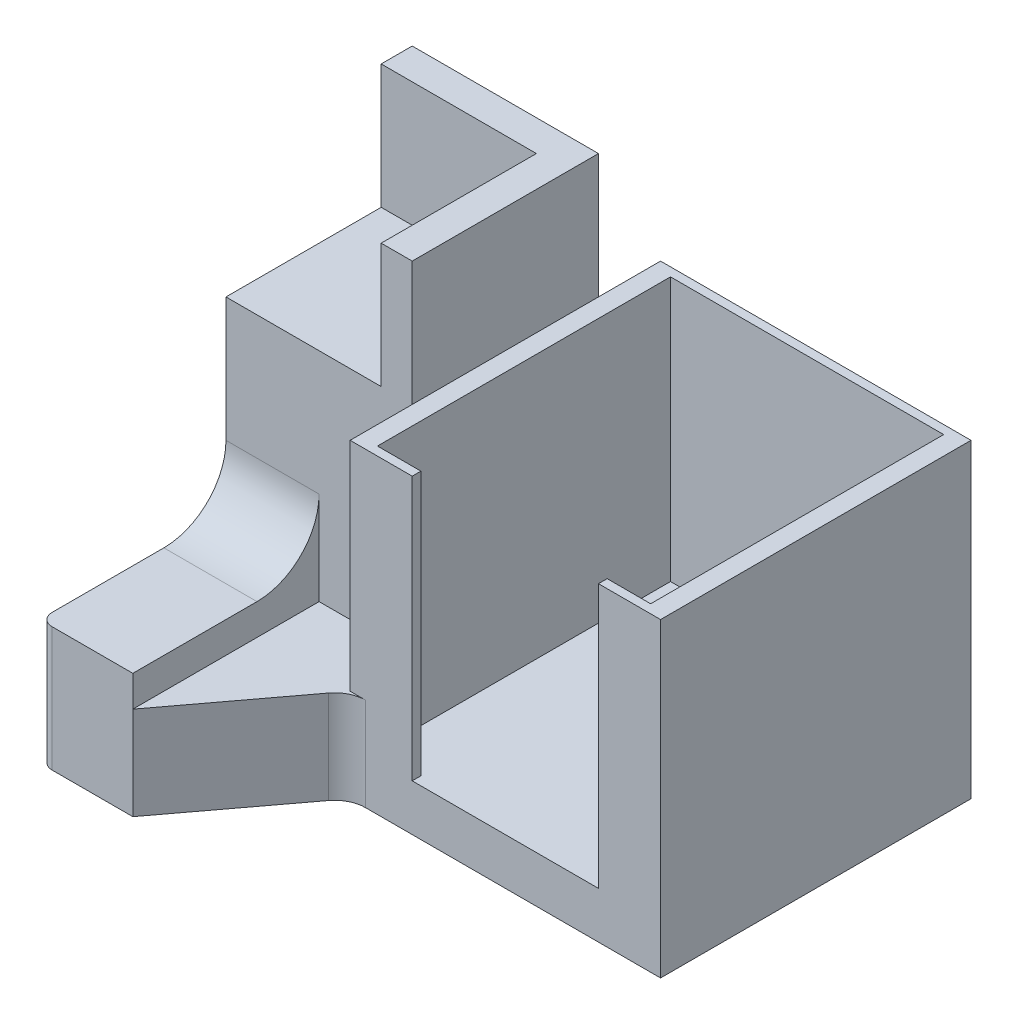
ISO-10303-21;
HEADER;
FILE_DESCRIPTION(('STEP AP214'),'2;1');
FILE_NAME('part.step','',(''),(''),'','','');
FILE_SCHEMA(('AUTOMOTIVE_DESIGN { 1 0 10303 214 1 1 1 1 }'));
ENDSEC;
DATA;
#1=APPLICATION_CONTEXT('core data for automotive mechanical design processes');
#2=APPLICATION_PROTOCOL_DEFINITION('international standard','automotive_design',2000,#1);
#3=PRODUCT_CONTEXT('',#1,'mechanical');
#4=PRODUCT('Part','Part','',(#3));
#5=PRODUCT_RELATED_PRODUCT_CATEGORY('part','',(#4));
#6=PRODUCT_DEFINITION_FORMATION('','',#4);
#7=PRODUCT_DEFINITION_CONTEXT('part definition',#1,'design');
#8=PRODUCT_DEFINITION('design','',#6,#7);
#9=PRODUCT_DEFINITION_SHAPE('','',#8);
#10=(LENGTH_UNIT() NAMED_UNIT(*) SI_UNIT(.MILLI.,.METRE.));
#11=(NAMED_UNIT(*) PLANE_ANGLE_UNIT() SI_UNIT($,.RADIAN.));
#12=(NAMED_UNIT(*) SI_UNIT($,.STERADIAN.) SOLID_ANGLE_UNIT());
#13=UNCERTAINTY_MEASURE_WITH_UNIT(LENGTH_MEASURE(1.E-05),#10,'distance_accuracy_value','');
#14=(GEOMETRIC_REPRESENTATION_CONTEXT(3) GLOBAL_UNCERTAINTY_ASSIGNED_CONTEXT((#13)) GLOBAL_UNIT_ASSIGNED_CONTEXT((#10,
#11,#12)) REPRESENTATION_CONTEXT('',''));
#15=CARTESIAN_POINT('',(0.,0.,0.));
#16=DIRECTION('',(0.,0.,1.));
#17=DIRECTION('',(1.,0.,0.));
#18=AXIS2_PLACEMENT_3D('',#15,#16,#17);
#19=CARTESIAN_POINT('',(-25.,25.,50.));
#20=DIRECTION('',(0.,-1.,0.));
#21=DIRECTION('',(0.,0.,-1.));
#22=AXIS2_PLACEMENT_3D('',#19,#20,#21);
#23=PLANE('',#22);
#24=DIRECTION('',(0.,0.,-1.));
#25=VECTOR('',#24,1.);
#26=CARTESIAN_POINT('',(-25.,25.,10.));
#27=LINE('',#26,#25);
#28=CARTESIAN_POINT('',(-25.,25.,40.));
#29=VERTEX_POINT('',#28);
#30=CARTESIAN_POINT('',(-25.,25.,10.));
#31=VERTEX_POINT('',#30);
#32=EDGE_CURVE('E275',#29,#31,#27,.T.);
#33=ORIENTED_EDGE('',*,*,#32,.F.);
#34=DIRECTION('',(0.,0.,-1.));
#35=VECTOR('',#34,1.);
#36=CARTESIAN_POINT('',(-25.,25.,50.));
#37=LINE('',#36,#35);
#38=CARTESIAN_POINT('',(-25.,25.,50.));
#39=VERTEX_POINT('',#38);
#40=EDGE_CURVE('E465',#39,#29,#37,.T.);
#41=ORIENTED_EDGE('',*,*,#40,.F.);
#42=DIRECTION('',(-1.,0.,0.));
#43=VECTOR('',#42,1.);
#44=CARTESIAN_POINT('',(-25.,25.,50.));
#45=LINE('',#44,#43);
#46=CARTESIAN_POINT('',(-15.,25.,50.));
#47=VERTEX_POINT('',#46);
#48=EDGE_CURVE('E440',#47,#39,#45,.T.);
#49=ORIENTED_EDGE('',*,*,#48,.F.);
#50=DIRECTION('',(0.,0.,1.));
#51=VECTOR('',#50,1.);
#52=CARTESIAN_POINT('',(-15.,25.,48.6));
#53=LINE('',#52,#51);
#54=CARTESIAN_POINT('',(-15.,25.,48.6));
#55=VERTEX_POINT('',#54);
#56=EDGE_CURVE('E404',#55,#47,#53,.T.);
#57=ORIENTED_EDGE('',*,*,#56,.F.);
#58=DIRECTION('',(1.,0.,0.));
#59=VECTOR('',#58,1.);
#60=CARTESIAN_POINT('',(-22.,25.,48.6));
#61=LINE('',#60,#59);
#62=CARTESIAN_POINT('',(-22.,25.,48.6));
#63=VERTEX_POINT('',#62);
#64=EDGE_CURVE('E379',#63,#55,#61,.T.);
#65=ORIENTED_EDGE('',*,*,#64,.F.);
#66=DIRECTION('',(0.,0.,-1.));
#67=VECTOR('',#66,1.);
#68=CARTESIAN_POINT('',(-22.,25.,48.6));
#69=LINE('',#68,#67);
#70=CARTESIAN_POINT('',(-22.,25.,1.4));
#71=VERTEX_POINT('',#70);
#72=EDGE_CURVE('E384',#63,#71,#69,.T.);
#73=ORIENTED_EDGE('',*,*,#72,.T.);
#74=DIRECTION('',(1.,0.,0.));
#75=VECTOR('',#74,1.);
#76=CARTESIAN_POINT('',(-22.,25.,1.4));
#77=LINE('',#76,#75);
#78=CARTESIAN_POINT('',(22.,25.,1.4));
#79=VERTEX_POINT('',#78);
#80=EDGE_CURVE('E415',#71,#79,#77,.T.);
#81=ORIENTED_EDGE('',*,*,#80,.T.);
#82=DIRECTION('',(0.,0.,-1.));
#83=VECTOR('',#82,1.);
#84=CARTESIAN_POINT('',(22.,25.,48.6));
#85=LINE('',#84,#83);
#86=CARTESIAN_POINT('',(22.,25.,48.6));
#87=VERTEX_POINT('',#86);
#88=EDGE_CURVE('E412',#87,#79,#85,.T.);
#89=ORIENTED_EDGE('',*,*,#88,.F.);
#90=DIRECTION('',(1.,0.,0.));
#91=VECTOR('',#90,1.);
#92=CARTESIAN_POINT('',(15.,25.,48.6));
#93=LINE('',#92,#91);
#94=CARTESIAN_POINT('',(15.,25.,48.6));
#95=VERTEX_POINT('',#94);
#96=EDGE_CURVE('E409',#95,#87,#93,.T.);
#97=ORIENTED_EDGE('',*,*,#96,.F.);
#98=DIRECTION('',(0.,0.,1.));
#99=VECTOR('',#98,1.);
#100=CARTESIAN_POINT('',(15.,25.,48.6));
#101=LINE('',#100,#99);
#102=CARTESIAN_POINT('',(15.,25.,50.));
#103=VERTEX_POINT('',#102);
#104=EDGE_CURVE('E406',#95,#103,#101,.T.);
#105=ORIENTED_EDGE('',*,*,#104,.T.);
#106=CARTESIAN_POINT('',(25.,25.,50.));
#107=VERTEX_POINT('',#106);
#108=EDGE_CURVE('E442',#107,#103,#45,.T.);
#109=ORIENTED_EDGE('',*,*,#108,.F.);
#110=DIRECTION('',(0.,0.,-1.));
#111=VECTOR('',#110,1.);
#112=CARTESIAN_POINT('',(25.,25.,50.));
#113=LINE('',#112,#111);
#114=CARTESIAN_POINT('',(25.,25.,0.));
#115=VERTEX_POINT('',#114);
#116=EDGE_CURVE('E468',#107,#115,#113,.T.);
#117=ORIENTED_EDGE('',*,*,#116,.T.);
#118=DIRECTION('',(-1.,0.,0.));
#119=VECTOR('',#118,1.);
#120=CARTESIAN_POINT('',(-25.,25.,0.));
#121=LINE('',#120,#119);
#122=CARTESIAN_POINT('',(-25.,25.,0.));
#123=VERTEX_POINT('',#122);
#124=EDGE_CURVE('E453',#115,#123,#121,.T.);
#125=ORIENTED_EDGE('',*,*,#124,.T.);
#126=EDGE_CURVE('E464',#31,#123,#37,.T.);
#127=ORIENTED_EDGE('',*,*,#126,.F.);
#128=EDGE_LOOP('',(#33,#41,#49,#57,#65,#73,#81,#89,#97,#105,#109,#117,#125,#127));
#129=FACE_BOUND('',#128,.T.);
#130=ADVANCED_FACE('F41',(#129),#23,.F.);
#131=DIRECTION('',(0.,0.,1.));
#132=VECTOR('',#131,1.);
#133=CARTESIAN_POINT('',(-30.,25.,40.));
#134=LINE('',#133,#132);
#135=CARTESIAN_POINT('',(-30.,25.,15.));
#136=VERTEX_POINT('',#135);
#137=CARTESIAN_POINT('',(-30.,25.,40.));
#138=VERTEX_POINT('',#137);
#139=EDGE_CURVE('E278',#136,#138,#134,.T.);
#140=ORIENTED_EDGE('',*,*,#139,.F.);
#141=DIRECTION('',(1.,0.,0.));
#142=VECTOR('',#141,1.);
#143=CARTESIAN_POINT('',(-30.,25.,15.));
#144=LINE('',#143,#142);
#145=CARTESIAN_POINT('',(-55.,25.,15.));
#146=VERTEX_POINT('',#145);
#147=EDGE_CURVE('E61',#146,#136,#144,.T.);
#148=ORIENTED_EDGE('',*,*,#147,.F.);
#149=DIRECTION('',(0.,0.,-1.));
#150=VECTOR('',#149,1.);
#151=CARTESIAN_POINT('',(-55.,25.,10.));
#152=LINE('',#151,#150);
#153=CARTESIAN_POINT('',(-55.,25.,40.));
#154=VERTEX_POINT('',#153);
#155=EDGE_CURVE('E372',#154,#146,#152,.T.);
#156=ORIENTED_EDGE('',*,*,#155,.F.);
#157=DIRECTION('',(1.,0.,0.));
#158=VECTOR('',#157,1.);
#159=CARTESIAN_POINT('',(-55.,25.,40.));
#160=LINE('',#159,#158);
#161=EDGE_CURVE('E56',#154,#138,#160,.T.);
#162=ORIENTED_EDGE('',*,*,#161,.T.);
#163=EDGE_LOOP('',(#140,#148,#156,#162));
#164=FACE_BOUND('',#163,.T.);
#165=ADVANCED_FACE('F539',(#164),#23,.F.);
#166=CARTESIAN_POINT('',(-55.,25.,40.));
#167=DIRECTION('',(0.,0.,-1.));
#168=DIRECTION('',(0.,1.,0.));
#169=AXIS2_PLACEMENT_3D('',#166,#167,#168);
#170=PLANE('',#169);
#171=DIRECTION('',(-1.,0.,0.));
#172=VECTOR('',#171,1.);
#173=CARTESIAN_POINT('',(-25.,-10.,40.));
#174=LINE('',#173,#172);
#175=CARTESIAN_POINT('',(-25.,-10.,40.));
#176=VERTEX_POINT('',#175);
#177=CARTESIAN_POINT('',(-40.,-10.,40.));
#178=VERTEX_POINT('',#177);
#179=EDGE_CURVE('E309',#176,#178,#174,.T.);
#180=ORIENTED_EDGE('',*,*,#179,.F.);
#181=DIRECTION('',(0.,1.,0.));
#182=VECTOR('',#181,1.);
#183=CARTESIAN_POINT('',(-25.,25.,40.));
#184=LINE('',#183,#182);
#185=EDGE_CURVE('E259',#176,#29,#184,.T.);
#186=ORIENTED_EDGE('',*,*,#185,.T.);
#187=DIRECTION('',(0.,-1.,0.));
#188=VECTOR('',#187,1.);
#189=CARTESIAN_POINT('',(-25.,45.,40.));
#190=LINE('',#189,#188);
#191=CARTESIAN_POINT('',(-25.,45.,40.));
#192=VERTEX_POINT('',#191);
#193=EDGE_CURVE('E291',#192,#29,#190,.T.);
#194=ORIENTED_EDGE('',*,*,#193,.F.);
#195=DIRECTION('',(1.,0.,0.));
#196=VECTOR('',#195,1.);
#197=CARTESIAN_POINT('',(-25.,45.,40.));
#198=LINE('',#197,#196);
#199=CARTESIAN_POINT('',(-30.,45.,40.));
#200=VERTEX_POINT('',#199);
#201=EDGE_CURVE('E284',#200,#192,#198,.T.);
#202=ORIENTED_EDGE('',*,*,#201,.F.);
#203=DIRECTION('',(0.,-1.,0.));
#204=VECTOR('',#203,1.);
#205=CARTESIAN_POINT('',(-30.,45.,40.));
#206=LINE('',#205,#204);
#207=EDGE_CURVE('E294',#200,#138,#206,.T.);
#208=ORIENTED_EDGE('',*,*,#207,.T.);
#209=ORIENTED_EDGE('',*,*,#161,.F.);
#210=DIRECTION('',(0.,1.,0.));
#211=VECTOR('',#210,1.);
#212=CARTESIAN_POINT('',(-55.,25.,40.));
#213=LINE('',#212,#211);
#214=CARTESIAN_POINT('',(-55.,5.,40.));
#215=VERTEX_POINT('',#214);
#216=EDGE_CURVE('E370',#215,#154,#213,.T.);
#217=ORIENTED_EDGE('',*,*,#216,.F.);
#218=DIRECTION('',(-1.,0.,0.));
#219=VECTOR('',#218,1.);
#220=CARTESIAN_POINT('',(-55.,5.,40.));
#221=LINE('',#220,#219);
#222=CARTESIAN_POINT('',(-40.,5.,40.));
#223=VERTEX_POINT('',#222);
#224=EDGE_CURVE('E474',#215,#223,#221,.F.);
#225=ORIENTED_EDGE('',*,*,#224,.T.);
#226=DIRECTION('',(0.,-1.,0.));
#227=VECTOR('',#226,1.);
#228=CARTESIAN_POINT('',(-40.,-25.,40.));
#229=LINE('',#228,#227);
#230=EDGE_CURVE('E326',#223,#178,#229,.T.);
#231=ORIENTED_EDGE('',*,*,#230,.T.);
#232=EDGE_LOOP('',(#180,#186,#194,#202,#208,#209,#217,#225,#231));
#233=FACE_BOUND('',#232,.T.);
#234=ADVANCED_FACE('F536',(#233),#170,.F.);
#235=CARTESIAN_POINT('',(-25.,-25.,50.));
#236=DIRECTION('',(1.,0.,0.));
#237=DIRECTION('',(0.,0.,-1.));
#238=AXIS2_PLACEMENT_3D('',#235,#236,#237);
#239=PLANE('',#238);
#240=DIRECTION('',(0.,0.,-1.));
#241=VECTOR('',#240,1.);
#242=CARTESIAN_POINT('',(-25.,-10.,50.));
#243=LINE('',#242,#241);
#244=CARTESIAN_POINT('',(-25.,-10.,50.));
#245=VERTEX_POINT('',#244);
#246=EDGE_CURVE('E307',#245,#176,#243,.T.);
#247=ORIENTED_EDGE('',*,*,#246,.F.);
#248=DIRECTION('',(0.,-1.,0.));
#249=VECTOR('',#248,1.);
#250=CARTESIAN_POINT('',(-25.,-25.,50.));
#251=LINE('',#250,#249);
#252=EDGE_CURVE('E445',#39,#245,#251,.T.);
#253=ORIENTED_EDGE('',*,*,#252,.F.);
#254=ORIENTED_EDGE('',*,*,#40,.T.);
#255=ORIENTED_EDGE('',*,*,#185,.F.);
#256=EDGE_LOOP('',(#247,#253,#254,#255));
#257=FACE_BOUND('',#256,.T.);
#258=ADVANCED_FACE('F582',(#257),#239,.F.);
#259=CARTESIAN_POINT('',(-40.,0.,0.));
#260=DIRECTION('',(1.,0.,0.));
#261=DIRECTION('',(0.,0.,-1.));
#262=AXIS2_PLACEMENT_3D('',#259,#260,#261);
#263=PLANE('',#262);
#264=DIRECTION('',(0.,1.,0.));
#265=VECTOR('',#264,1.);
#266=CARTESIAN_POINT('',(-40.,-25.,70.));
#267=LINE('',#266,#265);
#268=CARTESIAN_POINT('',(-40.,-10.,70.));
#269=VERTEX_POINT('',#268);
#270=CARTESIAN_POINT('',(-40.,-5.,70.));
#271=VERTEX_POINT('',#270);
#272=EDGE_CURVE('E331',#269,#271,#267,.T.);
#273=ORIENTED_EDGE('',*,*,#272,.F.);
#274=DIRECTION('',(0.,0.,1.));
#275=VECTOR('',#274,1.);
#276=CARTESIAN_POINT('',(-40.,-10.,40.));
#277=LINE('',#276,#275);
#278=EDGE_CURVE('E301',#178,#269,#277,.T.);
#279=ORIENTED_EDGE('',*,*,#278,.F.);
#280=ORIENTED_EDGE('',*,*,#230,.F.);
#281=CARTESIAN_POINT('',(-40.,5.,50.));
#282=DIRECTION('',(1.,0.,0.));
#283=DIRECTION('',(0.,0.,-1.));
#284=AXIS2_PLACEMENT_3D('',#281,#282,#283);
#285=CIRCLE('',#284,10.);
#286=CARTESIAN_POINT('',(-40.,-5.,50.));
#287=VERTEX_POINT('',#286);
#288=EDGE_CURVE('E479',#223,#287,#285,.F.);
#289=ORIENTED_EDGE('',*,*,#288,.T.);
#290=DIRECTION('',(0.,0.,-1.));
#291=VECTOR('',#290,1.);
#292=CARTESIAN_POINT('',(-40.,-5.,40.));
#293=LINE('',#292,#291);
#294=EDGE_CURVE('E319',#271,#287,#293,.T.);
#295=ORIENTED_EDGE('',*,*,#294,.F.);
#296=EDGE_LOOP('',(#273,#279,#280,#289,#295));
#297=FACE_BOUND('',#296,.T.);
#298=ADVANCED_FACE('F586',(#297),#263,.T.);
#299=DIRECTION('',(0.,-1.,0.));
#300=VECTOR('',#299,1.);
#301=CARTESIAN_POINT('',(-25.,25.,10.));
#302=LINE('',#301,#300);
#303=CARTESIAN_POINT('',(-25.,-25.,10.));
#304=VERTEX_POINT('',#303);
#305=EDGE_CURVE('E367',#31,#304,#302,.T.);
#306=ORIENTED_EDGE('',*,*,#305,.F.);
#307=ORIENTED_EDGE('',*,*,#126,.T.);
#308=DIRECTION('',(0.,-1.,0.));
#309=VECTOR('',#308,1.);
#310=CARTESIAN_POINT('',(-25.,-25.,0.));
#311=LINE('',#310,#309);
#312=CARTESIAN_POINT('',(-25.,-25.,0.));
#313=VERTEX_POINT('',#312);
#314=EDGE_CURVE('E456',#123,#313,#311,.T.);
#315=ORIENTED_EDGE('',*,*,#314,.T.);
#316=DIRECTION('',(0.,0.,-1.));
#317=VECTOR('',#316,1.);
#318=CARTESIAN_POINT('',(-25.,-25.,50.));
#319=LINE('',#318,#317);
#320=EDGE_CURVE('E462',#304,#313,#319,.T.);
#321=ORIENTED_EDGE('',*,*,#320,.F.);
#322=EDGE_LOOP('',(#306,#307,#315,#321));
#323=FACE_BOUND('',#322,.T.);
#324=ADVANCED_FACE('F552',(#323),#239,.F.);
#325=CARTESIAN_POINT('',(0.,0.,50.));
#326=DIRECTION('',(0.,0.,-1.));
#327=DIRECTION('',(-1.,0.,0.));
#328=AXIS2_PLACEMENT_3D('',#325,#326,#327);
#329=PLANE('',#328);
#330=ORIENTED_EDGE('',*,*,#252,.T.);
#331=DIRECTION('',(1.,0.,0.));
#332=VECTOR('',#331,1.);
#333=CARTESIAN_POINT('',(0.,-10.,50.));
#334=LINE('',#333,#332);
#335=CARTESIAN_POINT('',(-22.5,-10.,50.));
#336=VERTEX_POINT('',#335);
#337=EDGE_CURVE('E495',#245,#336,#334,.T.);
#338=ORIENTED_EDGE('',*,*,#337,.T.);
#339=DIRECTION('',(0.,1.,0.));
#340=VECTOR('',#339,1.);
#341=CARTESIAN_POINT('',(-22.5,0.,50.));
#342=LINE('',#341,#340);
#343=CARTESIAN_POINT('',(-22.5,-25.,50.));
#344=VERTEX_POINT('',#343);
#345=EDGE_CURVE('E493',#336,#344,#342,.F.);
#346=ORIENTED_EDGE('',*,*,#345,.T.);
#347=DIRECTION('',(1.,0.,0.));
#348=VECTOR('',#347,1.);
#349=CARTESIAN_POINT('',(-25.,-25.,50.));
#350=LINE('',#349,#348);
#351=CARTESIAN_POINT('',(25.,-25.,50.));
#352=VERTEX_POINT('',#351);
#353=EDGE_CURVE('E448',#344,#352,#350,.T.);
#354=ORIENTED_EDGE('',*,*,#353,.T.);
#355=DIRECTION('',(0.,1.,0.));
#356=VECTOR('',#355,1.);
#357=CARTESIAN_POINT('',(25.,-25.,50.));
#358=LINE('',#357,#356);
#359=EDGE_CURVE('E437',#352,#107,#358,.T.);
#360=ORIENTED_EDGE('',*,*,#359,.T.);
#361=ORIENTED_EDGE('',*,*,#108,.T.);
#362=DIRECTION('',(0.,1.,0.));
#363=VECTOR('',#362,1.);
#364=CARTESIAN_POINT('',(15.,-17.5,50.));
#365=LINE('',#364,#363);
#366=CARTESIAN_POINT('',(15.,-17.5,50.));
#367=VERTEX_POINT('',#366);
#368=EDGE_CURVE('E431',#367,#103,#365,.T.);
#369=ORIENTED_EDGE('',*,*,#368,.F.);
#370=DIRECTION('',(1.,0.,0.));
#371=VECTOR('',#370,1.);
#372=CARTESIAN_POINT('',(-15.,-17.5,50.));
#373=LINE('',#372,#371);
#374=CARTESIAN_POINT('',(-15.,-17.5,50.));
#375=VERTEX_POINT('',#374);
#376=EDGE_CURVE('E386',#375,#367,#373,.T.);
#377=ORIENTED_EDGE('',*,*,#376,.F.);
#378=DIRECTION('',(0.,1.,0.));
#379=VECTOR('',#378,1.);
#380=CARTESIAN_POINT('',(-15.,-17.5,50.));
#381=LINE('',#380,#379);
#382=EDGE_CURVE('E433',#375,#47,#381,.T.);
#383=ORIENTED_EDGE('',*,*,#382,.T.);
#384=ORIENTED_EDGE('',*,*,#48,.T.);
#385=EDGE_LOOP('',(#330,#338,#346,#354,#360,#361,#369,#377,#383,#384));
#386=FACE_BOUND('',#385,.T.);
#387=ADVANCED_FACE('F503',(#386),#329,.F.);
#388=CARTESIAN_POINT('',(25.,-25.,50.));
#389=DIRECTION('',(-1.,0.,0.));
#390=DIRECTION('',(0.,0.,1.));
#391=AXIS2_PLACEMENT_3D('',#388,#389,#390);
#392=PLANE('',#391);
#393=DIRECTION('',(0.,1.,0.));
#394=VECTOR('',#393,1.);
#395=CARTESIAN_POINT('',(25.,-25.,0.));
#396=LINE('',#395,#394);
#397=CARTESIAN_POINT('',(25.,-25.,0.));
#398=VERTEX_POINT('',#397);
#399=EDGE_CURVE('E422',#398,#115,#396,.T.);
#400=ORIENTED_EDGE('',*,*,#399,.T.);
#401=ORIENTED_EDGE('',*,*,#116,.F.);
#402=ORIENTED_EDGE('',*,*,#359,.F.);
#403=DIRECTION('',(0.,0.,-1.));
#404=VECTOR('',#403,1.);
#405=CARTESIAN_POINT('',(25.,-25.,50.));
#406=LINE('',#405,#404);
#407=EDGE_CURVE('E450',#352,#398,#406,.T.);
#408=ORIENTED_EDGE('',*,*,#407,.T.);
#409=EDGE_LOOP('',(#400,#401,#402,#408));
#410=FACE_BOUND('',#409,.T.);
#411=ADVANCED_FACE('F563',(#410),#392,.F.);
#412=CARTESIAN_POINT('',(-25.,-25.,50.));
#413=DIRECTION('',(0.,1.,0.));
#414=DIRECTION('',(0.,0.,1.));
#415=AXIS2_PLACEMENT_3D('',#412,#413,#414);
#416=PLANE('',#415);
#417=DIRECTION('',(1.,0.,0.));
#418=VECTOR('',#417,1.);
#419=CARTESIAN_POINT('',(-50.,-25.,15.));
#420=LINE('',#419,#418);
#421=CARTESIAN_POINT('',(-50.,-25.,15.));
#422=VERTEX_POINT('',#421);
#423=CARTESIAN_POINT('',(-30.,-25.,15.));
#424=VERTEX_POINT('',#423);
#425=EDGE_CURVE('E350',#422,#424,#420,.T.);
#426=ORIENTED_EDGE('',*,*,#425,.F.);
#427=DIRECTION('',(0.,0.,-1.));
#428=VECTOR('',#427,1.);
#429=CARTESIAN_POINT('',(-50.,-25.,35.));
#430=LINE('',#429,#428);
#431=CARTESIAN_POINT('',(-50.,-25.,35.));
#432=VERTEX_POINT('',#431);
#433=EDGE_CURVE('E338',#432,#422,#430,.T.);
#434=ORIENTED_EDGE('',*,*,#433,.F.);
#435=DIRECTION('',(1.,0.,0.));
#436=VECTOR('',#435,1.);
#437=CARTESIAN_POINT('',(-50.,-25.,35.));
#438=LINE('',#437,#436);
#439=CARTESIAN_POINT('',(-30.,-25.,35.));
#440=VERTEX_POINT('',#439);
#441=EDGE_CURVE('E356',#432,#440,#438,.T.);
#442=ORIENTED_EDGE('',*,*,#441,.T.);
#443=DIRECTION('',(0.,0.,-1.));
#444=VECTOR('',#443,1.);
#445=CARTESIAN_POINT('',(-30.,-25.,35.));
#446=LINE('',#445,#444);
#447=EDGE_CURVE('E353',#440,#424,#446,.T.);
#448=ORIENTED_EDGE('',*,*,#447,.T.);
#449=EDGE_LOOP('',(#426,#434,#442,#448));
#450=FACE_BOUND('',#449,.T.);
#451=DIRECTION('',(-1.,0.,0.));
#452=VECTOR('',#451,1.);
#453=CARTESIAN_POINT('',(-40.,-25.,70.));
#454=LINE('',#453,#452);
#455=CARTESIAN_POINT('',(-40.,-25.,70.));
#456=VERTEX_POINT('',#455);
#457=CARTESIAN_POINT('',(-53.,-25.,70.));
#458=VERTEX_POINT('',#457);
#459=EDGE_CURVE('E335',#456,#458,#454,.T.);
#460=ORIENTED_EDGE('',*,*,#459,.T.);
#461=CARTESIAN_POINT('',(-53.,-25.,68.));
#462=DIRECTION('',(0.,1.,0.));
#463=DIRECTION('',(0.,0.,1.));
#464=AXIS2_PLACEMENT_3D('',#461,#462,#463);
#465=CIRCLE('',#464,2.);
#466=CARTESIAN_POINT('',(-55.,-25.,68.));
#467=VERTEX_POINT('',#466);
#468=EDGE_CURVE('E488',#458,#467,#465,.F.);
#469=ORIENTED_EDGE('',*,*,#468,.T.);
#470=DIRECTION('',(0.,0.,1.));
#471=VECTOR('',#470,1.);
#472=CARTESIAN_POINT('',(-55.,-25.,10.));
#473=LINE('',#472,#471);
#474=CARTESIAN_POINT('',(-55.,-25.,10.));
#475=VERTEX_POINT('',#474);
#476=EDGE_CURVE('E258',#475,#467,#473,.T.);
#477=ORIENTED_EDGE('',*,*,#476,.F.);
#478=DIRECTION('',(1.,0.,0.));
#479=VECTOR('',#478,1.);
#480=CARTESIAN_POINT('',(-55.,-25.,10.));
#481=LINE('',#480,#479);
#482=EDGE_CURVE('E255',#475,#304,#481,.T.);
#483=ORIENTED_EDGE('',*,*,#482,.T.);
#484=ORIENTED_EDGE('',*,*,#320,.T.);
#485=DIRECTION('',(1.,0.,0.));
#486=VECTOR('',#485,1.);
#487=CARTESIAN_POINT('',(-25.,-25.,0.));
#488=LINE('',#487,#486);
#489=EDGE_CURVE('E441',#313,#398,#488,.T.);
#490=ORIENTED_EDGE('',*,*,#489,.T.);
#491=ORIENTED_EDGE('',*,*,#407,.F.);
#492=ORIENTED_EDGE('',*,*,#353,.F.);
#493=CARTESIAN_POINT('',(-22.5,-25.,55.));
#494=DIRECTION('',(0.,1.,0.));
#495=DIRECTION('',(0.,0.,1.));
#496=AXIS2_PLACEMENT_3D('',#493,#494,#495);
#497=CIRCLE('',#496,5.);
#498=CARTESIAN_POINT('',(-26.5,-25.,52.));
#499=VERTEX_POINT('',#498);
#500=EDGE_CURVE('E12',#344,#499,#497,.T.);
#501=ORIENTED_EDGE('',*,*,#500,.T.);
#502=DIRECTION('',(-0.6,0.,0.8));
#503=VECTOR('',#502,1.);
#504=CARTESIAN_POINT('',(-40.,-25.,70.));
#505=LINE('',#504,#503);
#506=EDGE_CURVE('E311',#499,#456,#505,.T.);
#507=ORIENTED_EDGE('',*,*,#506,.T.);
#508=EDGE_LOOP('',(#460,#469,#477,#483,#484,#490,#491,#492,#501,#507));
#509=FACE_BOUND('',#508,.T.);
#510=ADVANCED_FACE('F510',(#450,#509),#416,.F.);
#511=CARTESIAN_POINT('',(0.,0.,0.));
#512=DIRECTION('',(0.,0.,-1.));
#513=DIRECTION('',(-1.,0.,0.));
#514=AXIS2_PLACEMENT_3D('',#511,#512,#513);
#515=PLANE('',#514);
#516=ORIENTED_EDGE('',*,*,#399,.F.);
#517=ORIENTED_EDGE('',*,*,#489,.F.);
#518=ORIENTED_EDGE('',*,*,#314,.F.);
#519=ORIENTED_EDGE('',*,*,#124,.F.);
#520=EDGE_LOOP('',(#516,#517,#518,#519));
#521=FACE_BOUND('',#520,.T.);
#522=ADVANCED_FACE('F560',(#521),#515,.T.);
#523=CARTESIAN_POINT('',(-22.,-17.5,48.6));
#524=DIRECTION('',(0.,0.,1.));
#525=DIRECTION('',(1.,0.,0.));
#526=AXIS2_PLACEMENT_3D('',#523,#524,#525);
#527=PLANE('',#526);
#528=ORIENTED_EDGE('',*,*,#64,.T.);
#529=DIRECTION('',(0.,1.,0.));
#530=VECTOR('',#529,1.);
#531=CARTESIAN_POINT('',(-15.,-17.5,48.6));
#532=LINE('',#531,#530);
#533=CARTESIAN_POINT('',(-15.,-17.5,48.6));
#534=VERTEX_POINT('',#533);
#535=EDGE_CURVE('E401',#534,#55,#532,.T.);
#536=ORIENTED_EDGE('',*,*,#535,.F.);
#537=DIRECTION('',(1.,0.,0.));
#538=VECTOR('',#537,1.);
#539=CARTESIAN_POINT('',(-22.,-17.5,48.6));
#540=LINE('',#539,#538);
#541=CARTESIAN_POINT('',(-22.,-17.5,48.6));
#542=VERTEX_POINT('',#541);
#543=EDGE_CURVE('E380',#542,#534,#540,.T.);
#544=ORIENTED_EDGE('',*,*,#543,.F.);
#545=DIRECTION('',(0.,1.,0.));
#546=VECTOR('',#545,1.);
#547=CARTESIAN_POINT('',(-22.,-17.5,48.6));
#548=LINE('',#547,#546);
#549=EDGE_CURVE('E420',#542,#63,#548,.T.);
#550=ORIENTED_EDGE('',*,*,#549,.T.);
#551=EDGE_LOOP('',(#528,#536,#544,#550));
#552=FACE_BOUND('',#551,.T.);
#553=ADVANCED_FACE('F656',(#552),#527,.F.);
#554=CARTESIAN_POINT('',(-22.,-17.5,48.6));
#555=DIRECTION('',(1.,0.,0.));
#556=DIRECTION('',(0.,0.,-1.));
#557=AXIS2_PLACEMENT_3D('',#554,#555,#556);
#558=PLANE('',#557);
#559=ORIENTED_EDGE('',*,*,#72,.F.);
#560=ORIENTED_EDGE('',*,*,#549,.F.);
#561=DIRECTION('',(0.,0.,-1.));
#562=VECTOR('',#561,1.);
#563=CARTESIAN_POINT('',(-22.,-17.5,48.6));
#564=LINE('',#563,#562);
#565=CARTESIAN_POINT('',(-22.,-17.5,1.4));
#566=VERTEX_POINT('',#565);
#567=EDGE_CURVE('E399',#542,#566,#564,.T.);
#568=ORIENTED_EDGE('',*,*,#567,.T.);
#569=DIRECTION('',(0.,1.,0.));
#570=VECTOR('',#569,1.);
#571=CARTESIAN_POINT('',(-22.,-17.5,1.4));
#572=LINE('',#571,#570);
#573=EDGE_CURVE('E423',#566,#71,#572,.T.);
#574=ORIENTED_EDGE('',*,*,#573,.T.);
#575=EDGE_LOOP('',(#559,#560,#568,#574));
#576=FACE_BOUND('',#575,.T.);
#577=ADVANCED_FACE('F652',(#576),#558,.T.);
#578=CARTESIAN_POINT('',(-22.,-17.5,1.4));
#579=DIRECTION('',(0.,0.,1.));
#580=DIRECTION('',(1.,0.,0.));
#581=AXIS2_PLACEMENT_3D('',#578,#579,#580);
#582=PLANE('',#581);
#583=ORIENTED_EDGE('',*,*,#80,.F.);
#584=ORIENTED_EDGE('',*,*,#573,.F.);
#585=DIRECTION('',(1.,0.,0.));
#586=VECTOR('',#585,1.);
#587=CARTESIAN_POINT('',(-22.,-17.5,1.4));
#588=LINE('',#587,#586);
#589=CARTESIAN_POINT('',(22.,-17.5,1.4));
#590=VERTEX_POINT('',#589);
#591=EDGE_CURVE('E397',#566,#590,#588,.T.);
#592=ORIENTED_EDGE('',*,*,#591,.T.);
#593=DIRECTION('',(0.,1.,0.));
#594=VECTOR('',#593,1.);
#595=CARTESIAN_POINT('',(22.,-17.5,1.4));
#596=LINE('',#595,#594);
#597=EDGE_CURVE('E425',#590,#79,#596,.T.);
#598=ORIENTED_EDGE('',*,*,#597,.T.);
#599=EDGE_LOOP('',(#583,#584,#592,#598));
#600=FACE_BOUND('',#599,.T.);
#601=ADVANCED_FACE('F655',(#600),#582,.T.);
#602=CARTESIAN_POINT('',(22.,-17.5,48.6));
#603=DIRECTION('',(1.,0.,0.));
#604=DIRECTION('',(0.,0.,-1.));
#605=AXIS2_PLACEMENT_3D('',#602,#603,#604);
#606=PLANE('',#605);
#607=ORIENTED_EDGE('',*,*,#88,.T.);
#608=ORIENTED_EDGE('',*,*,#597,.F.);
#609=DIRECTION('',(0.,0.,-1.));
#610=VECTOR('',#609,1.);
#611=CARTESIAN_POINT('',(22.,-17.5,48.6));
#612=LINE('',#611,#610);
#613=CARTESIAN_POINT('',(22.,-17.5,48.6));
#614=VERTEX_POINT('',#613);
#615=EDGE_CURVE('E394',#614,#590,#612,.T.);
#616=ORIENTED_EDGE('',*,*,#615,.F.);
#617=DIRECTION('',(0.,1.,0.));
#618=VECTOR('',#617,1.);
#619=CARTESIAN_POINT('',(22.,-17.5,48.6));
#620=LINE('',#619,#618);
#621=EDGE_CURVE('E427',#614,#87,#620,.T.);
#622=ORIENTED_EDGE('',*,*,#621,.T.);
#623=EDGE_LOOP('',(#607,#608,#616,#622));
#624=FACE_BOUND('',#623,.T.);
#625=ADVANCED_FACE('F660',(#624),#606,.F.);
#626=CARTESIAN_POINT('',(15.,-17.5,48.6));
#627=DIRECTION('',(0.,0.,1.));
#628=DIRECTION('',(1.,0.,0.));
#629=AXIS2_PLACEMENT_3D('',#626,#627,#628);
#630=PLANE('',#629);
#631=ORIENTED_EDGE('',*,*,#96,.T.);
#632=ORIENTED_EDGE('',*,*,#621,.F.);
#633=DIRECTION('',(1.,0.,0.));
#634=VECTOR('',#633,1.);
#635=CARTESIAN_POINT('',(15.,-17.5,48.6));
#636=LINE('',#635,#634);
#637=CARTESIAN_POINT('',(15.,-17.5,48.6));
#638=VERTEX_POINT('',#637);
#639=EDGE_CURVE('E391',#638,#614,#636,.T.);
#640=ORIENTED_EDGE('',*,*,#639,.F.);
#641=DIRECTION('',(0.,1.,0.));
#642=VECTOR('',#641,1.);
#643=CARTESIAN_POINT('',(15.,-17.5,48.6));
#644=LINE('',#643,#642);
#645=EDGE_CURVE('E429',#638,#95,#644,.T.);
#646=ORIENTED_EDGE('',*,*,#645,.T.);
#647=EDGE_LOOP('',(#631,#632,#640,#646));
#648=FACE_BOUND('',#647,.T.);
#649=ADVANCED_FACE('F664',(#648),#630,.F.);
#650=CARTESIAN_POINT('',(15.,-17.5,48.6));
#651=DIRECTION('',(-1.,0.,0.));
#652=DIRECTION('',(0.,0.,1.));
#653=AXIS2_PLACEMENT_3D('',#650,#651,#652);
#654=PLANE('',#653);
#655=ORIENTED_EDGE('',*,*,#104,.F.);
#656=ORIENTED_EDGE('',*,*,#645,.F.);
#657=DIRECTION('',(0.,0.,1.));
#658=VECTOR('',#657,1.);
#659=CARTESIAN_POINT('',(15.,-17.5,48.6));
#660=LINE('',#659,#658);
#661=EDGE_CURVE('E389',#638,#367,#660,.T.);
#662=ORIENTED_EDGE('',*,*,#661,.T.);
#663=ORIENTED_EDGE('',*,*,#368,.T.);
#664=EDGE_LOOP('',(#655,#656,#662,#663));
#665=FACE_BOUND('',#664,.T.);
#666=ADVANCED_FACE('F570',(#665),#654,.T.);
#667=CARTESIAN_POINT('',(-15.,-17.5,48.6));
#668=DIRECTION('',(-1.,0.,0.));
#669=DIRECTION('',(0.,0.,1.));
#670=AXIS2_PLACEMENT_3D('',#667,#668,#669);
#671=PLANE('',#670);
#672=ORIENTED_EDGE('',*,*,#56,.T.);
#673=ORIENTED_EDGE('',*,*,#382,.F.);
#674=DIRECTION('',(0.,0.,1.));
#675=VECTOR('',#674,1.);
#676=CARTESIAN_POINT('',(-15.,-17.5,48.6));
#677=LINE('',#676,#675);
#678=EDGE_CURVE('E383',#534,#375,#677,.T.);
#679=ORIENTED_EDGE('',*,*,#678,.F.);
#680=ORIENTED_EDGE('',*,*,#535,.T.);
#681=EDGE_LOOP('',(#672,#673,#679,#680));
#682=FACE_BOUND('',#681,.T.);
#683=ADVANCED_FACE('F651',(#682),#671,.F.);
#684=CARTESIAN_POINT('',(0.,-17.5,0.));
#685=DIRECTION('',(0.,-1.,0.));
#686=DIRECTION('',(0.,0.,-1.));
#687=AXIS2_PLACEMENT_3D('',#684,#685,#686);
#688=PLANE('',#687);
#689=ORIENTED_EDGE('',*,*,#543,.T.);
#690=ORIENTED_EDGE('',*,*,#678,.T.);
#691=ORIENTED_EDGE('',*,*,#376,.T.);
#692=ORIENTED_EDGE('',*,*,#661,.F.);
#693=ORIENTED_EDGE('',*,*,#639,.T.);
#694=ORIENTED_EDGE('',*,*,#615,.T.);
#695=ORIENTED_EDGE('',*,*,#591,.F.);
#696=ORIENTED_EDGE('',*,*,#567,.F.);
#697=EDGE_LOOP('',(#689,#690,#691,#692,#693,#694,#695,#696));
#698=FACE_BOUND('',#697,.T.);
#699=ADVANCED_FACE('F574',(#698),#688,.F.);
#700=CARTESIAN_POINT('',(-55.,25.,10.));
#701=DIRECTION('',(0.,0.,1.));
#702=DIRECTION('',(0.,-1.,0.));
#703=AXIS2_PLACEMENT_3D('',#700,#701,#702);
#704=PLANE('',#703);
#705=ORIENTED_EDGE('',*,*,#305,.T.);
#706=ORIENTED_EDGE('',*,*,#482,.F.);
#707=DIRECTION('',(0.,-1.,0.));
#708=VECTOR('',#707,1.);
#709=CARTESIAN_POINT('',(-55.,25.,10.));
#710=LINE('',#709,#708);
#711=CARTESIAN_POINT('',(-55.,45.,10.));
#712=VERTEX_POINT('',#711);
#713=EDGE_CURVE('E247',#712,#475,#710,.T.);
#714=ORIENTED_EDGE('',*,*,#713,.F.);
#715=DIRECTION('',(-1.,0.,0.));
#716=VECTOR('',#715,1.);
#717=CARTESIAN_POINT('',(-55.,45.,10.));
#718=LINE('',#717,#716);
#719=CARTESIAN_POINT('',(-25.,45.,10.));
#720=VERTEX_POINT('',#719);
#721=EDGE_CURVE('E253',#720,#712,#718,.T.);
#722=ORIENTED_EDGE('',*,*,#721,.F.);
#723=DIRECTION('',(0.,-1.,0.));
#724=VECTOR('',#723,1.);
#725=CARTESIAN_POINT('',(-25.,45.,10.));
#726=LINE('',#725,#724);
#727=EDGE_CURVE('E287',#720,#31,#726,.T.);
#728=ORIENTED_EDGE('',*,*,#727,.T.);
#729=EDGE_LOOP('',(#705,#706,#714,#722,#728));
#730=FACE_BOUND('',#729,.T.);
#731=ADVANCED_FACE('F250',(#730),#704,.F.);
#732=CARTESIAN_POINT('',(-55.,0.,0.));
#733=DIRECTION('',(-1.,0.,0.));
#734=DIRECTION('',(0.,0.,1.));
#735=AXIS2_PLACEMENT_3D('',#732,#733,#734);
#736=PLANE('',#735);
#737=ORIENTED_EDGE('',*,*,#476,.T.);
#738=DIRECTION('',(0.,1.,0.));
#739=VECTOR('',#738,1.);
#740=CARTESIAN_POINT('',(-55.,0.,68.));
#741=LINE('',#740,#739);
#742=CARTESIAN_POINT('',(-55.,-5.,68.));
#743=VERTEX_POINT('',#742);
#744=EDGE_CURVE('E481',#467,#743,#741,.T.);
#745=ORIENTED_EDGE('',*,*,#744,.T.);
#746=DIRECTION('',(0.,0.,1.));
#747=VECTOR('',#746,1.);
#748=CARTESIAN_POINT('',(-55.,-5.,40.));
#749=LINE('',#748,#747);
#750=CARTESIAN_POINT('',(-55.,-5.,50.));
#751=VERTEX_POINT('',#750);
#752=EDGE_CURVE('E313',#751,#743,#749,.T.);
#753=ORIENTED_EDGE('',*,*,#752,.F.);
#754=CARTESIAN_POINT('',(-55.,5.,50.));
#755=DIRECTION('',(-1.,0.,0.));
#756=DIRECTION('',(0.,0.,1.));
#757=AXIS2_PLACEMENT_3D('',#754,#755,#756);
#758=CIRCLE('',#757,10.);
#759=EDGE_CURVE('E477',#751,#215,#758,.F.);
#760=ORIENTED_EDGE('',*,*,#759,.T.);
#761=ORIENTED_EDGE('',*,*,#216,.T.);
#762=ORIENTED_EDGE('',*,*,#155,.T.);
#763=DIRECTION('',(0.,-1.,0.));
#764=VECTOR('',#763,1.);
#765=CARTESIAN_POINT('',(-55.,45.,15.));
#766=LINE('',#765,#764);
#767=CARTESIAN_POINT('',(-55.,45.,15.));
#768=VERTEX_POINT('',#767);
#769=EDGE_CURVE('E266',#768,#146,#766,.T.);
#770=ORIENTED_EDGE('',*,*,#769,.F.);
#771=DIRECTION('',(0.,0.,1.));
#772=VECTOR('',#771,1.);
#773=CARTESIAN_POINT('',(-55.,45.,15.));
#774=LINE('',#773,#772);
#775=EDGE_CURVE('E262',#712,#768,#774,.T.);
#776=ORIENTED_EDGE('',*,*,#775,.F.);
#777=ORIENTED_EDGE('',*,*,#713,.T.);
#778=EDGE_LOOP('',(#737,#745,#753,#760,#761,#762,#770,#776,#777));
#779=FACE_BOUND('',#778,.T.);
#780=CARTESIAN_POINT('',(-55.,-15.,62.2));
#781=DIRECTION('',(-1.,0.,0.));
#782=DIRECTION('',(0.,0.,1.));
#783=AXIS2_PLACEMENT_3D('',#780,#781,#782);
#784=CIRCLE('',#783,4.05);
#785=CARTESIAN_POINT('',(-55.,-15.,66.25));
#786=VERTEX_POINT('',#785);
#787=EDGE_CURVE('E322',#786,#786,#784,.T.);
#788=ORIENTED_EDGE('',*,*,#787,.F.);
#789=EDGE_LOOP('',(#788));
#790=FACE_BOUND('',#789,.T.);
#791=ADVANCED_FACE('F263',(#779,#790),#736,.T.);
#792=CARTESIAN_POINT('',(-50.,53.2842712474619,35.));
#793=DIRECTION('',(-1.,0.,0.));
#794=DIRECTION('',(0.,0.,1.));
#795=AXIS2_PLACEMENT_3D('',#792,#793,#794);
#796=PLANE('',#795);
#797=DIRECTION('',(0.,0.,1.));
#798=VECTOR('',#797,1.);
#799=CARTESIAN_POINT('',(-50.,20.,35.));
#800=LINE('',#799,#798);
#801=CARTESIAN_POINT('',(-50.,20.,15.));
#802=VERTEX_POINT('',#801);
#803=CARTESIAN_POINT('',(-50.,20.,35.));
#804=VERTEX_POINT('',#803);
#805=EDGE_CURVE('E346',#802,#804,#800,.T.);
#806=ORIENTED_EDGE('',*,*,#805,.T.);
#807=DIRECTION('',(0.,-1.,0.));
#808=VECTOR('',#807,1.);
#809=CARTESIAN_POINT('',(-50.,53.2842712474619,35.));
#810=LINE('',#809,#808);
#811=EDGE_CURVE('E343',#804,#432,#810,.T.);
#812=ORIENTED_EDGE('',*,*,#811,.T.);
#813=ORIENTED_EDGE('',*,*,#433,.T.);
#814=DIRECTION('',(0.,-1.,0.));
#815=VECTOR('',#814,1.);
#816=CARTESIAN_POINT('',(-50.,53.2842712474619,15.));
#817=LINE('',#816,#815);
#818=EDGE_CURVE('E359',#802,#422,#817,.T.);
#819=ORIENTED_EDGE('',*,*,#818,.F.);
#820=EDGE_LOOP('',(#806,#812,#813,#819));
#821=FACE_BOUND('',#820,.T.);
#822=ADVANCED_FACE('F636',(#821),#796,.F.);
#823=CARTESIAN_POINT('',(-50.,53.2842712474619,35.));
#824=DIRECTION('',(0.,0.,-1.));
#825=DIRECTION('',(-1.,0.,0.));
#826=AXIS2_PLACEMENT_3D('',#823,#824,#825);
#827=PLANE('',#826);
#828=DIRECTION('',(0.,-1.,0.));
#829=VECTOR('',#828,1.);
#830=CARTESIAN_POINT('',(-30.,53.2842712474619,35.));
#831=LINE('',#830,#829);
#832=CARTESIAN_POINT('',(-30.,20.,35.));
#833=VERTEX_POINT('',#832);
#834=EDGE_CURVE('E361',#833,#440,#831,.T.);
#835=ORIENTED_EDGE('',*,*,#834,.T.);
#836=ORIENTED_EDGE('',*,*,#441,.F.);
#837=ORIENTED_EDGE('',*,*,#811,.F.);
#838=DIRECTION('',(-1.,0.,0.));
#839=VECTOR('',#838,1.);
#840=CARTESIAN_POINT('',(-50.,20.,35.));
#841=LINE('',#840,#839);
#842=EDGE_CURVE('E342',#833,#804,#841,.T.);
#843=ORIENTED_EDGE('',*,*,#842,.F.);
#844=EDGE_LOOP('',(#835,#836,#837,#843));
#845=FACE_BOUND('',#844,.T.);
#846=ADVANCED_FACE('F642',(#845),#827,.T.);
#847=CARTESIAN_POINT('',(-30.,53.2842712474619,35.));
#848=DIRECTION('',(-1.,0.,0.));
#849=DIRECTION('',(0.,0.,1.));
#850=AXIS2_PLACEMENT_3D('',#847,#848,#849);
#851=PLANE('',#850);
#852=DIRECTION('',(0.,-1.,0.));
#853=VECTOR('',#852,1.);
#854=CARTESIAN_POINT('',(-30.,53.2842712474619,15.));
#855=LINE('',#854,#853);
#856=CARTESIAN_POINT('',(-30.,20.,15.));
#857=VERTEX_POINT('',#856);
#858=EDGE_CURVE('E363',#857,#424,#855,.T.);
#859=ORIENTED_EDGE('',*,*,#858,.T.);
#860=ORIENTED_EDGE('',*,*,#447,.F.);
#861=ORIENTED_EDGE('',*,*,#834,.F.);
#862=DIRECTION('',(0.,0.,1.));
#863=VECTOR('',#862,1.);
#864=CARTESIAN_POINT('',(-30.,20.,35.));
#865=LINE('',#864,#863);
#866=EDGE_CURVE('E339',#857,#833,#865,.T.);
#867=ORIENTED_EDGE('',*,*,#866,.F.);
#868=EDGE_LOOP('',(#859,#860,#861,#867));
#869=FACE_BOUND('',#868,.T.);
#870=ADVANCED_FACE('F696',(#869),#851,.T.);
#871=CARTESIAN_POINT('',(-50.,53.2842712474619,15.));
#872=DIRECTION('',(0.,0.,-1.));
#873=DIRECTION('',(-1.,0.,0.));
#874=AXIS2_PLACEMENT_3D('',#871,#872,#873);
#875=PLANE('',#874);
#876=DIRECTION('',(-1.,0.,0.));
#877=VECTOR('',#876,1.);
#878=CARTESIAN_POINT('',(-50.,20.,15.));
#879=LINE('',#878,#877);
#880=EDGE_CURVE('E348',#857,#802,#879,.T.);
#881=ORIENTED_EDGE('',*,*,#880,.T.);
#882=ORIENTED_EDGE('',*,*,#818,.T.);
#883=ORIENTED_EDGE('',*,*,#425,.T.);
#884=ORIENTED_EDGE('',*,*,#858,.F.);
#885=EDGE_LOOP('',(#881,#882,#883,#884));
#886=FACE_BOUND('',#885,.T.);
#887=ADVANCED_FACE('F687',(#886),#875,.F.);
#888=CARTESIAN_POINT('',(-25.,20.,50.));
#889=DIRECTION('',(0.,-1.,0.));
#890=DIRECTION('',(0.,0.,-1.));
#891=AXIS2_PLACEMENT_3D('',#888,#889,#890);
#892=PLANE('',#891);
#893=ORIENTED_EDGE('',*,*,#805,.F.);
#894=ORIENTED_EDGE('',*,*,#880,.F.);
#895=ORIENTED_EDGE('',*,*,#866,.T.);
#896=ORIENTED_EDGE('',*,*,#842,.T.);
#897=EDGE_LOOP('',(#893,#894,#895,#896));
#898=FACE_BOUND('',#897,.T.);
#899=ADVANCED_FACE('F631',(#898),#892,.T.);
#900=CARTESIAN_POINT('',(-40.,-25.,70.));
#901=DIRECTION('',(0.,0.,1.));
#902=DIRECTION('',(1.,0.,0.));
#903=AXIS2_PLACEMENT_3D('',#900,#901,#902);
#904=PLANE('',#903);
#905=DIRECTION('',(1.,0.,0.));
#906=VECTOR('',#905,1.);
#907=CARTESIAN_POINT('',(-55.,-5.,70.));
#908=LINE('',#907,#906);
#909=CARTESIAN_POINT('',(-53.,-5.,70.));
#910=VERTEX_POINT('',#909);
#911=EDGE_CURVE('E316',#910,#271,#908,.T.);
#912=ORIENTED_EDGE('',*,*,#911,.F.);
#913=DIRECTION('',(0.,1.,0.));
#914=VECTOR('',#913,1.);
#915=CARTESIAN_POINT('',(-53.,-25.,70.));
#916=LINE('',#915,#914);
#917=EDGE_CURVE('E486',#910,#458,#916,.F.);
#918=ORIENTED_EDGE('',*,*,#917,.T.);
#919=ORIENTED_EDGE('',*,*,#459,.F.);
#920=EDGE_CURVE('E332',#456,#269,#267,.T.);
#921=ORIENTED_EDGE('',*,*,#920,.T.);
#922=ORIENTED_EDGE('',*,*,#272,.T.);
#923=EDGE_LOOP('',(#912,#918,#919,#921,#922));
#924=FACE_BOUND('',#923,.T.);
#925=ADVANCED_FACE('F518',(#924),#904,.T.);
#926=CARTESIAN_POINT('',(-45.,-15.,62.2));
#927=DIRECTION('',(-1.,0.,0.));
#928=DIRECTION('',(0.,0.,1.));
#929=AXIS2_PLACEMENT_3D('',#926,#927,#928);
#930=CYLINDRICAL_SURFACE('',#929,4.05);
#931=CARTESIAN_POINT('',(-45.,-15.,62.2));
#932=DIRECTION('',(-1.,0.,0.));
#933=DIRECTION('',(0.,0.,1.));
#934=AXIS2_PLACEMENT_3D('',#931,#932,#933);
#935=CIRCLE('',#934,4.05);
#936=CARTESIAN_POINT('',(-45.,-15.,66.25));
#937=VERTEX_POINT('',#936);
#938=EDGE_CURVE('E323',#937,#937,#935,.T.);
#939=ORIENTED_EDGE('',*,*,#938,.F.);
#940=EDGE_LOOP('',(#939));
#941=FACE_BOUND('',#940,.T.);
#942=ORIENTED_EDGE('',*,*,#787,.T.);
#943=EDGE_LOOP('',(#942));
#944=FACE_BOUND('',#943,.T.);
#945=ADVANCED_FACE('F624',(#941,#944),#930,.F.);
#946=CARTESIAN_POINT('',(-45.,-15.,62.2));
#947=DIRECTION('',(-1.,0.,0.));
#948=DIRECTION('',(0.,0.,1.));
#949=AXIS2_PLACEMENT_3D('',#946,#947,#948);
#950=PLANE('',#949);
#951=ORIENTED_EDGE('',*,*,#938,.T.);
#952=EDGE_LOOP('',(#951));
#953=FACE_BOUND('',#952,.T.);
#954=ADVANCED_FACE('F622',(#953),#950,.T.);
#955=CARTESIAN_POINT('',(0.,-5.,0.));
#956=DIRECTION('',(0.,1.,0.));
#957=DIRECTION('',(0.,0.,1.));
#958=AXIS2_PLACEMENT_3D('',#955,#956,#957);
#959=PLANE('',#958);
#960=ORIENTED_EDGE('',*,*,#752,.T.);
#961=CARTESIAN_POINT('',(-53.,-5.,68.));
#962=DIRECTION('',(0.,1.,0.));
#963=DIRECTION('',(0.,0.,1.));
#964=AXIS2_PLACEMENT_3D('',#961,#962,#963);
#965=CIRCLE('',#964,2.);
#966=EDGE_CURVE('E484',#743,#910,#965,.T.);
#967=ORIENTED_EDGE('',*,*,#966,.T.);
#968=ORIENTED_EDGE('',*,*,#911,.T.);
#969=ORIENTED_EDGE('',*,*,#294,.T.);
#970=DIRECTION('',(-1.,0.,0.));
#971=VECTOR('',#970,1.);
#972=CARTESIAN_POINT('',(0.,-5.,50.));
#973=LINE('',#972,#971);
#974=EDGE_CURVE('E471',#287,#751,#973,.T.);
#975=ORIENTED_EDGE('',*,*,#974,.T.);
#976=EDGE_LOOP('',(#960,#967,#968,#969,#975));
#977=FACE_BOUND('',#976,.T.);
#978=ADVANCED_FACE('F526',(#977),#959,.T.);
#979=CARTESIAN_POINT('',(0.,5.,50.));
#980=DIRECTION('',(-1.,0.,0.));
#981=DIRECTION('',(0.,0.,1.));
#982=AXIS2_PLACEMENT_3D('',#979,#980,#981);
#983=CYLINDRICAL_SURFACE('',#982,10.);
#984=ORIENTED_EDGE('',*,*,#288,.F.);
#985=ORIENTED_EDGE('',*,*,#224,.F.);
#986=ORIENTED_EDGE('',*,*,#759,.F.);
#987=ORIENTED_EDGE('',*,*,#974,.F.);
#988=EDGE_LOOP('',(#984,#985,#986,#987));
#989=FACE_BOUND('',#988,.T.);
#990=ADVANCED_FACE('F531',(#989),#983,.F.);
#991=CARTESIAN_POINT('',(-53.,0.,68.));
#992=DIRECTION('',(0.,1.,0.));
#993=DIRECTION('',(0.,0.,1.));
#994=AXIS2_PLACEMENT_3D('',#991,#992,#993);
#995=CYLINDRICAL_SURFACE('',#994,2.);
#996=ORIENTED_EDGE('',*,*,#468,.F.);
#997=ORIENTED_EDGE('',*,*,#917,.F.);
#998=ORIENTED_EDGE('',*,*,#966,.F.);
#999=ORIENTED_EDGE('',*,*,#744,.F.);
#1000=EDGE_LOOP('',(#996,#997,#998,#999));
#1001=FACE_BOUND('',#1000,.T.);
#1002=ADVANCED_FACE('F523',(#1001),#995,.T.);
#1003=CARTESIAN_POINT('',(-40.,-58.5410196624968,70.));
#1004=DIRECTION('',(0.8,0.,0.6));
#1005=DIRECTION('',(0.6,0.,-0.8));
#1006=AXIS2_PLACEMENT_3D('',#1003,#1004,#1005);
#1007=PLANE('',#1006);
#1008=ORIENTED_EDGE('',*,*,#506,.F.);
#1009=DIRECTION('',(0.,1.,0.));
#1010=VECTOR('',#1009,1.);
#1011=CARTESIAN_POINT('',(-26.5,-58.5410196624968,52.));
#1012=LINE('',#1011,#1010);
#1013=CARTESIAN_POINT('',(-26.5,-10.,52.));
#1014=VERTEX_POINT('',#1013);
#1015=EDGE_CURVE('E490',#499,#1014,#1012,.T.);
#1016=ORIENTED_EDGE('',*,*,#1015,.T.);
#1017=DIRECTION('',(0.6,0.,-0.8));
#1018=VECTOR('',#1017,1.);
#1019=CARTESIAN_POINT('',(-40.,-10.,70.));
#1020=LINE('',#1019,#1018);
#1021=EDGE_CURVE('E304',#269,#1014,#1020,.T.);
#1022=ORIENTED_EDGE('',*,*,#1021,.F.);
#1023=ORIENTED_EDGE('',*,*,#920,.F.);
#1024=EDGE_LOOP('',(#1008,#1016,#1022,#1023));
#1025=FACE_BOUND('',#1024,.T.);
#1026=ADVANCED_FACE('F514',(#1025),#1007,.T.);
#1027=CARTESIAN_POINT('',(0.,-10.,0.));
#1028=DIRECTION('',(0.,-1.,0.));
#1029=DIRECTION('',(0.,0.,-1.));
#1030=AXIS2_PLACEMENT_3D('',#1027,#1028,#1029);
#1031=PLANE('',#1030);
#1032=ORIENTED_EDGE('',*,*,#278,.T.);
#1033=ORIENTED_EDGE('',*,*,#1021,.T.);
#1034=CARTESIAN_POINT('',(-22.5,-10.,55.));
#1035=DIRECTION('',(0.,-1.,0.));
#1036=DIRECTION('',(0.,0.,-1.));
#1037=AXIS2_PLACEMENT_3D('',#1034,#1035,#1036);
#1038=CIRCLE('',#1037,5.);
#1039=EDGE_CURVE('E49',#1014,#336,#1038,.T.);
#1040=ORIENTED_EDGE('',*,*,#1039,.T.);
#1041=ORIENTED_EDGE('',*,*,#337,.F.);
#1042=ORIENTED_EDGE('',*,*,#246,.T.);
#1043=ORIENTED_EDGE('',*,*,#179,.T.);
#1044=EDGE_LOOP('',(#1032,#1033,#1040,#1041,#1042,#1043));
#1045=FACE_BOUND('',#1044,.T.);
#1046=ADVANCED_FACE('F498',(#1045),#1031,.F.);
#1047=CARTESIAN_POINT('',(-22.5,-58.5410196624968,55.));
#1048=DIRECTION('',(0.,1.,0.));
#1049=DIRECTION('',(0.,0.,1.));
#1050=AXIS2_PLACEMENT_3D('',#1047,#1048,#1049);
#1051=CYLINDRICAL_SURFACE('',#1050,5.);
#1052=ORIENTED_EDGE('',*,*,#500,.F.);
#1053=ORIENTED_EDGE('',*,*,#345,.F.);
#1054=ORIENTED_EDGE('',*,*,#1039,.F.);
#1055=ORIENTED_EDGE('',*,*,#1015,.F.);
#1056=EDGE_LOOP('',(#1052,#1053,#1054,#1055));
#1057=FACE_BOUND('',#1056,.T.);
#1058=ADVANCED_FACE('F43',(#1057),#1051,.F.);
#1059=CARTESIAN_POINT('',(-30.,45.,15.));
#1060=DIRECTION('',(0.,0.,-1.));
#1061=DIRECTION('',(-1.,0.,0.));
#1062=AXIS2_PLACEMENT_3D('',#1059,#1060,#1061);
#1063=PLANE('',#1062);
#1064=ORIENTED_EDGE('',*,*,#147,.T.);
#1065=DIRECTION('',(0.,-1.,0.));
#1066=VECTOR('',#1065,1.);
#1067=CARTESIAN_POINT('',(-30.,45.,15.));
#1068=LINE('',#1067,#1066);
#1069=CARTESIAN_POINT('',(-30.,45.,15.));
#1070=VERTEX_POINT('',#1069);
#1071=EDGE_CURVE('E297',#1070,#136,#1068,.T.);
#1072=ORIENTED_EDGE('',*,*,#1071,.F.);
#1073=DIRECTION('',(1.,0.,0.));
#1074=VECTOR('',#1073,1.);
#1075=CARTESIAN_POINT('',(-30.,45.,15.));
#1076=LINE('',#1075,#1074);
#1077=EDGE_CURVE('E269',#768,#1070,#1076,.T.);
#1078=ORIENTED_EDGE('',*,*,#1077,.F.);
#1079=ORIENTED_EDGE('',*,*,#769,.T.);
#1080=EDGE_LOOP('',(#1064,#1072,#1078,#1079));
#1081=FACE_BOUND('',#1080,.T.);
#1082=ADVANCED_FACE('F541',(#1081),#1063,.F.);
#1083=CARTESIAN_POINT('',(-30.,45.,40.));
#1084=DIRECTION('',(1.,0.,0.));
#1085=DIRECTION('',(0.,0.,-1.));
#1086=AXIS2_PLACEMENT_3D('',#1083,#1084,#1085);
#1087=PLANE('',#1086);
#1088=ORIENTED_EDGE('',*,*,#139,.T.);
#1089=ORIENTED_EDGE('',*,*,#207,.F.);
#1090=DIRECTION('',(0.,0.,1.));
#1091=VECTOR('',#1090,1.);
#1092=CARTESIAN_POINT('',(-30.,45.,40.));
#1093=LINE('',#1092,#1091);
#1094=EDGE_CURVE('E282',#1070,#200,#1093,.T.);
#1095=ORIENTED_EDGE('',*,*,#1094,.F.);
#1096=ORIENTED_EDGE('',*,*,#1071,.T.);
#1097=EDGE_LOOP('',(#1088,#1089,#1095,#1096));
#1098=FACE_BOUND('',#1097,.T.);
#1099=ADVANCED_FACE('F546',(#1098),#1087,.F.);
#1100=CARTESIAN_POINT('',(-25.,45.,10.));
#1101=DIRECTION('',(-1.,0.,0.));
#1102=DIRECTION('',(0.,0.,1.));
#1103=AXIS2_PLACEMENT_3D('',#1100,#1101,#1102);
#1104=PLANE('',#1103);
#1105=ORIENTED_EDGE('',*,*,#32,.T.);
#1106=ORIENTED_EDGE('',*,*,#727,.F.);
#1107=DIRECTION('',(0.,0.,-1.));
#1108=VECTOR('',#1107,1.);
#1109=CARTESIAN_POINT('',(-25.,45.,10.));
#1110=LINE('',#1109,#1108);
#1111=EDGE_CURVE('E273',#192,#720,#1110,.T.);
#1112=ORIENTED_EDGE('',*,*,#1111,.F.);
#1113=ORIENTED_EDGE('',*,*,#193,.T.);
#1114=EDGE_LOOP('',(#1105,#1106,#1112,#1113));
#1115=FACE_BOUND('',#1114,.T.);
#1116=ADVANCED_FACE('F549',(#1115),#1104,.F.);
#1117=CARTESIAN_POINT('',(0.,45.,0.));
#1118=DIRECTION('',(0.,-1.,0.));
#1119=DIRECTION('',(0.,0.,-1.));
#1120=AXIS2_PLACEMENT_3D('',#1117,#1118,#1119);
#1121=PLANE('',#1120);
#1122=ORIENTED_EDGE('',*,*,#721,.T.);
#1123=ORIENTED_EDGE('',*,*,#775,.T.);
#1124=ORIENTED_EDGE('',*,*,#1077,.T.);
#1125=ORIENTED_EDGE('',*,*,#1094,.T.);
#1126=ORIENTED_EDGE('',*,*,#201,.T.);
#1127=ORIENTED_EDGE('',*,*,#1111,.T.);
#1128=EDGE_LOOP('',(#1122,#1123,#1124,#1125,#1126,#1127));
#1129=FACE_BOUND('',#1128,.T.);
#1130=ADVANCED_FACE('F271',(#1129),#1121,.F.);
#1131=CLOSED_SHELL('',(#130,#165,#234,#258,#298,#324,#387,#411,#510,#522,#553,#577,#601,#625,
#649,#666,#683,#699,#731,#791,#822,#846,#870,#887,#899,#925,#945,#954,#978,#990,#1002,#1026,
#1046,#1058,#1082,#1099,#1116,#1130));
#1132=MANIFOLD_SOLID_BREP('B2',#1131);
#1133=ADVANCED_BREP_SHAPE_REPRESENTATION('',(#18,#1132),#14);
#1134=SHAPE_DEFINITION_REPRESENTATION(#9,#1133);
ENDSEC;
END-ISO-10303-21;
